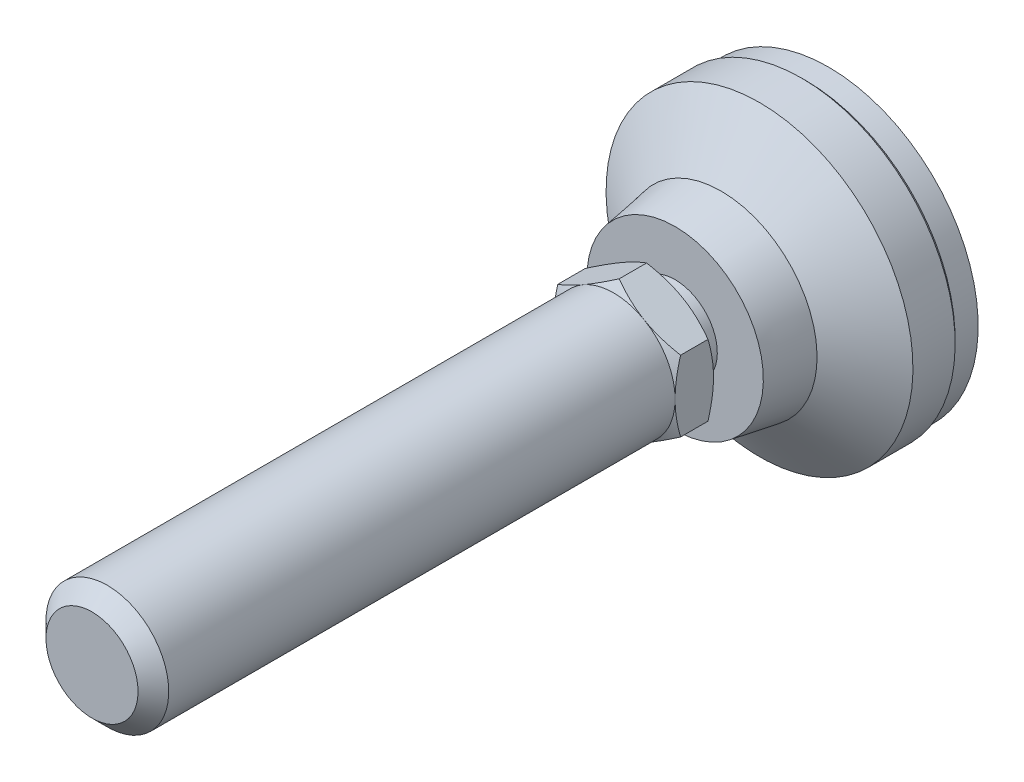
ISO-10303-21;
HEADER;
FILE_DESCRIPTION(('STEP AP214'),'2;1');
FILE_NAME('part.step','',(''),(''),'','','');
FILE_SCHEMA(('AUTOMOTIVE_DESIGN { 1 0 10303 214 1 1 1 1 }'));
ENDSEC;
DATA;
#1=APPLICATION_CONTEXT('core data for automotive mechanical design processes');
#2=APPLICATION_PROTOCOL_DEFINITION('international standard','automotive_design',2000,#1);
#3=PRODUCT_CONTEXT('',#1,'mechanical');
#4=PRODUCT('Part','Part','',(#3));
#5=PRODUCT_RELATED_PRODUCT_CATEGORY('part','',(#4));
#6=PRODUCT_DEFINITION_FORMATION('','',#4);
#7=PRODUCT_DEFINITION_CONTEXT('part definition',#1,'design');
#8=PRODUCT_DEFINITION('design','',#6,#7);
#9=PRODUCT_DEFINITION_SHAPE('','',#8);
#10=(LENGTH_UNIT() NAMED_UNIT(*) SI_UNIT(.MILLI.,.METRE.));
#11=(NAMED_UNIT(*) PLANE_ANGLE_UNIT() SI_UNIT($,.RADIAN.));
#12=(NAMED_UNIT(*) SI_UNIT($,.STERADIAN.) SOLID_ANGLE_UNIT());
#13=UNCERTAINTY_MEASURE_WITH_UNIT(LENGTH_MEASURE(1.E-05),#10,'distance_accuracy_value','');
#14=(GEOMETRIC_REPRESENTATION_CONTEXT(3) GLOBAL_UNCERTAINTY_ASSIGNED_CONTEXT((#13)) GLOBAL_UNIT_ASSIGNED_CONTEXT((#10,
#11,#12)) REPRESENTATION_CONTEXT('',''));
#15=CARTESIAN_POINT('',(0.,0.,0.));
#16=DIRECTION('',(0.,0.,1.));
#17=DIRECTION('',(1.,0.,0.));
#18=AXIS2_PLACEMENT_3D('',#15,#16,#17);
#19=CARTESIAN_POINT('',(0.,0.,2.));
#20=DIRECTION('',(0.,0.,-1.));
#21=DIRECTION('',(0.,1.,0.));
#22=AXIS2_PLACEMENT_3D('',#19,#20,#21);
#23=CYLINDRICAL_SURFACE('',#22,20.);
#24=CARTESIAN_POINT('',(0.,0.,3.5));
#25=DIRECTION('',(0.,0.,-1.));
#26=DIRECTION('',(0.,1.,0.));
#27=AXIS2_PLACEMENT_3D('',#24,#25,#26);
#28=CIRCLE('',#27,20.);
#29=CARTESIAN_POINT('',(0.,20.,3.5));
#30=VERTEX_POINT('',#29);
#31=EDGE_CURVE('E169',#30,#30,#28,.F.);
#32=ORIENTED_EDGE('',*,*,#31,.T.);
#33=EDGE_LOOP('',(#32));
#34=FACE_BOUND('',#33,.T.);
#35=CARTESIAN_POINT('',(0.,0.,9.));
#36=DIRECTION('',(0.,0.,-1.));
#37=DIRECTION('',(0.,1.,0.));
#38=AXIS2_PLACEMENT_3D('',#35,#36,#37);
#39=CIRCLE('',#38,20.);
#40=CARTESIAN_POINT('',(0.,20.,9.));
#41=VERTEX_POINT('',#40);
#42=EDGE_CURVE('E143',#41,#41,#39,.T.);
#43=ORIENTED_EDGE('',*,*,#42,.T.);
#44=EDGE_LOOP('',(#43));
#45=FACE_BOUND('',#44,.T.);
#46=ADVANCED_FACE('F14',(#34,#45),#23,.T.);
#47=CARTESIAN_POINT('',(0.,0.,2.));
#48=DIRECTION('',(0.,0.,-1.));
#49=DIRECTION('',(0.,1.,0.));
#50=AXIS2_PLACEMENT_3D('',#47,#48,#49);
#51=CYLINDRICAL_SURFACE('',#50,5.50000000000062);
#52=CARTESIAN_POINT('',(0.,0.,20.));
#53=DIRECTION('',(0.,0.,-1.));
#54=DIRECTION('',(0.,1.,0.));
#55=AXIS2_PLACEMENT_3D('',#52,#53,#54);
#56=CIRCLE('',#55,5.50000000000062);
#57=CARTESIAN_POINT('',(0.,5.50000000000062,20.));
#58=VERTEX_POINT('',#57);
#59=EDGE_CURVE('E153',#58,#58,#56,.T.);
#60=ORIENTED_EDGE('',*,*,#59,.F.);
#61=EDGE_LOOP('',(#60));
#62=FACE_BOUND('',#61,.T.);
#63=CARTESIAN_POINT('',(0.,0.,22.9999999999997));
#64=DIRECTION('',(0.,0.,-1.));
#65=DIRECTION('',(0.,1.,0.));
#66=AXIS2_PLACEMENT_3D('',#63,#64,#65);
#67=CIRCLE('',#66,5.50000000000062);
#68=CARTESIAN_POINT('',(0.,5.50000000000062,22.9999999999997));
#69=VERTEX_POINT('',#68);
#70=EDGE_CURVE('E134',#69,#69,#67,.T.);
#71=ORIENTED_EDGE('',*,*,#70,.T.);
#72=EDGE_LOOP('',(#71));
#73=FACE_BOUND('',#72,.T.);
#74=ADVANCED_FACE('F298',(#62,#73),#51,.T.);
#75=CARTESIAN_POINT('',(-11.5,0.,20.));
#76=DIRECTION('',(0.,0.,-1.));
#77=DIRECTION('',(0.,1.,0.));
#78=AXIS2_PLACEMENT_3D('',#75,#76,#77);
#79=PLANE('',#78);
#80=CARTESIAN_POINT('',(0.,0.,20.));
#81=DIRECTION('',(0.,0.,-1.));
#82=DIRECTION('',(0.,1.,0.));
#83=AXIS2_PLACEMENT_3D('',#80,#81,#82);
#84=CIRCLE('',#83,11.5);
#85=CARTESIAN_POINT('',(0.,11.5,20.));
#86=VERTEX_POINT('',#85);
#87=EDGE_CURVE('E150',#86,#86,#84,.T.);
#88=ORIENTED_EDGE('',*,*,#87,.F.);
#89=EDGE_LOOP('',(#88));
#90=FACE_BOUND('',#89,.T.);
#91=ORIENTED_EDGE('',*,*,#59,.T.);
#92=EDGE_LOOP('',(#91));
#93=FACE_BOUND('',#92,.T.);
#94=ADVANCED_FACE('F304',(#90,#93),#79,.F.);
#95=CARTESIAN_POINT('',(0.,0.,20.));
#96=DIRECTION('',(0.,0.,-1.));
#97=DIRECTION('',(0.,1.,0.));
#98=AXIS2_PLACEMENT_3D('',#95,#96,#97);
#99=CONICAL_SURFACE('',#98,11.5,0.165148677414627);
#100=CARTESIAN_POINT('',(0.,0.,14.));
#101=DIRECTION('',(0.,0.,-1.));
#102=DIRECTION('',(0.,1.,0.));
#103=AXIS2_PLACEMENT_3D('',#100,#101,#102);
#104=CIRCLE('',#103,12.5);
#105=CARTESIAN_POINT('',(0.,12.5,14.));
#106=VERTEX_POINT('',#105);
#107=EDGE_CURVE('E146',#106,#106,#104,.T.);
#108=ORIENTED_EDGE('',*,*,#107,.F.);
#109=EDGE_LOOP('',(#108));
#110=FACE_BOUND('',#109,.T.);
#111=ORIENTED_EDGE('',*,*,#87,.T.);
#112=EDGE_LOOP('',(#111));
#113=FACE_BOUND('',#112,.T.);
#114=ADVANCED_FACE('F313',(#110,#113),#99,.T.);
#115=CARTESIAN_POINT('',(0.,0.,14.));
#116=DIRECTION('',(0.,0.,-1.));
#117=DIRECTION('',(0.,1.,0.));
#118=AXIS2_PLACEMENT_3D('',#115,#116,#117);
#119=CONICAL_SURFACE('',#118,12.5,0.982793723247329);
#120=ORIENTED_EDGE('',*,*,#42,.F.);
#121=EDGE_LOOP('',(#120));
#122=FACE_BOUND('',#121,.T.);
#123=ORIENTED_EDGE('',*,*,#107,.T.);
#124=EDGE_LOOP('',(#123));
#125=FACE_BOUND('',#124,.T.);
#126=ADVANCED_FACE('F309',(#122,#125),#119,.T.);
#127=CARTESIAN_POINT('',(0.,-5.50000000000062,22.9999999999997));
#128=DIRECTION('',(0.,0.,-1.));
#129=DIRECTION('',(0.,1.,0.));
#130=AXIS2_PLACEMENT_3D('',#127,#128,#129);
#131=PLANE('',#130);
#132=CARTESIAN_POINT('',(0.,0.,22.9999999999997));
#133=DIRECTION('',(0.,0.,1.));
#134=DIRECTION('',(0.,-1.,0.));
#135=AXIS2_PLACEMENT_3D('',#132,#133,#134);
#136=CIRCLE('',#135,8.00000000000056);
#137=CARTESIAN_POINT('',(-4.,6.92820323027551,22.9999999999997));
#138=VERTEX_POINT('',#137);
#139=CARTESIAN_POINT('',(-8.,0.,22.9999999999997));
#140=VERTEX_POINT('',#139);
#141=EDGE_CURVE('E417',#138,#140,#136,.T.);
#142=ORIENTED_EDGE('',*,*,#141,.F.);
#143=CARTESIAN_POINT('',(4.,6.92820323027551,22.9999999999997));
#144=VERTEX_POINT('',#143);
#145=EDGE_CURVE('E115',#144,#138,#136,.T.);
#146=ORIENTED_EDGE('',*,*,#145,.F.);
#147=CARTESIAN_POINT('',(8.,0.,22.9999999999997));
#148=VERTEX_POINT('',#147);
#149=EDGE_CURVE('E422',#148,#144,#136,.T.);
#150=ORIENTED_EDGE('',*,*,#149,.F.);
#151=CARTESIAN_POINT('',(4.,-6.92820323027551,22.9999999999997));
#152=VERTEX_POINT('',#151);
#153=EDGE_CURVE('E35',#152,#148,#136,.T.);
#154=ORIENTED_EDGE('',*,*,#153,.F.);
#155=CARTESIAN_POINT('',(-4.,-6.92820323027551,22.9999999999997));
#156=VERTEX_POINT('',#155);
#157=EDGE_CURVE('E43',#156,#152,#136,.T.);
#158=ORIENTED_EDGE('',*,*,#157,.F.);
#159=EDGE_CURVE('E420',#140,#156,#136,.T.);
#160=ORIENTED_EDGE('',*,*,#159,.F.);
#161=EDGE_LOOP('',(#142,#146,#150,#154,#158,#160));
#162=FACE_BOUND('',#161,.T.);
#163=ORIENTED_EDGE('',*,*,#70,.F.);
#164=EDGE_LOOP('',(#163));
#165=FACE_BOUND('',#164,.T.);
#166=ADVANCED_FACE('F312',(#162,#165),#131,.T.);
#167=CARTESIAN_POINT('',(0.,0.,3.));
#168=DIRECTION('',(0.,0.,1.));
#169=DIRECTION('',(0.,-1.,0.));
#170=AXIS2_PLACEMENT_3D('',#167,#168,#169);
#171=CONICAL_SURFACE('',#170,19.5,0.785398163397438);
#172=ORIENTED_EDGE('',*,*,#31,.F.);
#173=EDGE_LOOP('',(#172));
#174=FACE_BOUND('',#173,.T.);
#175=CARTESIAN_POINT('',(0.,0.,3.));
#176=DIRECTION('',(0.,0.,-1.));
#177=DIRECTION('',(0.,1.,0.));
#178=AXIS2_PLACEMENT_3D('',#175,#176,#177);
#179=CIRCLE('',#178,19.5);
#180=CARTESIAN_POINT('',(0.,19.5,3.));
#181=VERTEX_POINT('',#180);
#182=EDGE_CURVE('E166',#181,#181,#179,.T.);
#183=ORIENTED_EDGE('',*,*,#182,.F.);
#184=EDGE_LOOP('',(#183));
#185=FACE_BOUND('',#184,.T.);
#186=ADVANCED_FACE('F16',(#174,#185),#171,.T.);
#187=CARTESIAN_POINT('',(0.,0.,0.));
#188=DIRECTION('',(0.,0.,1.));
#189=DIRECTION('',(0.,-1.,0.));
#190=AXIS2_PLACEMENT_3D('',#187,#188,#189);
#191=CYLINDRICAL_SURFACE('',#190,19.5);
#192=CARTESIAN_POINT('',(0.,0.,0.));
#193=DIRECTION('',(0.,0.,-1.));
#194=DIRECTION('',(0.,1.,0.));
#195=AXIS2_PLACEMENT_3D('',#192,#193,#194);
#196=CIRCLE('',#195,19.5);
#197=CARTESIAN_POINT('',(0.,19.5,0.));
#198=VERTEX_POINT('',#197);
#199=EDGE_CURVE('E139',#198,#198,#196,.T.);
#200=ORIENTED_EDGE('',*,*,#199,.F.);
#201=EDGE_LOOP('',(#200));
#202=FACE_BOUND('',#201,.T.);
#203=ORIENTED_EDGE('',*,*,#182,.T.);
#204=EDGE_LOOP('',(#203));
#205=FACE_BOUND('',#204,.T.);
#206=ADVANCED_FACE('F352',(#202,#205),#191,.T.);
#207=CARTESIAN_POINT('',(0.,0.,0.));
#208=DIRECTION('',(0.,0.,-1.));
#209=DIRECTION('',(0.,1.,0.));
#210=AXIS2_PLACEMENT_3D('',#207,#208,#209);
#211=PLANE('',#210);
#212=ORIENTED_EDGE('',*,*,#199,.T.);
#213=EDGE_LOOP('',(#212));
#214=FACE_BOUND('',#213,.T.);
#215=ADVANCED_FACE('F189',(#214),#211,.T.);
#216=CARTESIAN_POINT('',(0.,0.,22.9999999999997));
#217=DIRECTION('',(0.,0.,1.));
#218=DIRECTION('',(0.,-1.,0.));
#219=AXIS2_PLACEMENT_3D('',#216,#217,#218);
#220=CONICAL_SURFACE('',#219,8.00000000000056,1.0471975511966);
#221=CARTESIAN_POINT('',(-0.000199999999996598,9.23771977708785,23.7145978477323));
#222=CARTESIAN_POINT('',(0.1756487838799,9.13619343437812,23.6559907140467));
#223=CARTESIAN_POINT('',(0.352153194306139,9.03428856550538,23.6000434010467));
#224=CARTESIAN_POINT('',(0.706595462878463,8.82965122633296,23.494201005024));
#225=CARTESIAN_POINT('',(0.884533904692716,8.72691841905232,23.4443085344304));
#226=CARTESIAN_POINT('',(1.42119823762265,8.41707512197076,23.3046927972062));
#227=CARTESIAN_POINT('',(1.78204258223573,8.20874154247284,23.2252811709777));
#228=CARTESIAN_POINT('',(2.32203917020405,7.89697436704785,23.1321616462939));
#229=CARTESIAN_POINT('',(2.49957818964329,7.79447216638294,23.1056345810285));
#230=CARTESIAN_POINT('',(2.8554591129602,7.58900421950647,23.0611531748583));
#231=CARTESIAN_POINT('',(3.03380094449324,7.4860385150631,23.043198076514));
#232=CARTESIAN_POINT('',(3.3907916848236,7.27992981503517,23.0163156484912));
#233=CARTESIAN_POINT('',(3.5694400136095,7.17678715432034,23.0073780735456));
#234=CARTESIAN_POINT('',(3.92690170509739,6.97040655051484,22.9987223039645));
#235=CARTESIAN_POINT('',(4.10571506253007,6.86716861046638,22.9990038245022));
#236=CARTESIAN_POINT('',(4.44001336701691,6.67416139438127,23.0081450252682));
#237=CARTESIAN_POINT('',(4.59552190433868,6.58437849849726,23.0158896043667));
#238=CARTESIAN_POINT('',(4.90617476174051,6.40502298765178,23.0382011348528));
#239=CARTESIAN_POINT('',(5.06131905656,6.31545038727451,23.0527685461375));
#240=CARTESIAN_POINT('',(5.52615131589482,6.04707935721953,23.1063606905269));
#241=CARTESIAN_POINT('',(5.83501648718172,5.86875596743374,23.1552686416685));
#242=CARTESIAN_POINT('',(6.4560232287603,5.51021755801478,23.2775394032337));
#243=CARTESIAN_POINT('',(6.76808554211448,5.3300482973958,23.3514205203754));
#244=CARTESIAN_POINT('',(7.38755648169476,4.97239658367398,23.5191001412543));
#245=CARTESIAN_POINT('',(7.69497304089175,4.79490955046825,23.6128592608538));
#246=CARTESIAN_POINT('',(8.0002,4.61868668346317,23.7145978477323));
#247=B_SPLINE_CURVE_WITH_KNOTS('',3,(#221,#222,#223,#224,#225,#226,#227,#228,#229,#230,#231,
#232,#233,#234,#235,#236,#237,#238,#239,#240,#241,#242,#243,#244,#245,#246),.UNSPECIFIED.,.F.,
.F.,(4,2,2,2,2,2,2,2,2,2,2,2,4),(0.,0.63397354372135,1.26821965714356,2.53934712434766,
3.15934343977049,3.77928496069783,4.39852133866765,5.01773858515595,5.55680239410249,
6.09590254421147,7.17487077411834,8.27776850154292,9.37850115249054),.UNSPECIFIED.);
#248=CARTESIAN_POINT('',(0.,9.23760430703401,23.7145311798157));
#249=VERTEX_POINT('',#248);
#250=EDGE_CURVE('E112',#249,#144,#247,.T.);
#251=ORIENTED_EDGE('',*,*,#250,.T.);
#252=ORIENTED_EDGE('',*,*,#145,.T.);
#253=CARTESIAN_POINT('',(-8.0002,4.61868668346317,23.7145978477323));
#254=CARTESIAN_POINT('',(-7.8243512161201,4.7202130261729,23.6559907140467));
#255=CARTESIAN_POINT('',(-7.64784680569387,4.82211789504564,23.6000434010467));
#256=CARTESIAN_POINT('',(-7.29340453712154,5.02675523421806,23.494201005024));
#257=CARTESIAN_POINT('',(-7.11546609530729,5.1294880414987,23.4443085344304));
#258=CARTESIAN_POINT('',(-6.57880176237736,5.43933133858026,23.3046927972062));
#259=CARTESIAN_POINT('',(-6.21795741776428,5.64766491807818,23.2252811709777));
#260=CARTESIAN_POINT('',(-5.67796082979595,5.95943209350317,23.1321616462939));
#261=CARTESIAN_POINT('',(-5.50042181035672,6.06193429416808,23.1056345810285));
#262=CARTESIAN_POINT('',(-5.1445408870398,6.26740224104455,23.0611531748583));
#263=CARTESIAN_POINT('',(-4.96619905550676,6.37036794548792,23.043198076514));
#264=CARTESIAN_POINT('',(-4.60920831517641,6.57647664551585,23.0163156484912));
#265=CARTESIAN_POINT('',(-4.4305599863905,6.67961930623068,23.0073780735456));
#266=CARTESIAN_POINT('',(-4.07309829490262,6.88599991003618,22.9987223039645));
#267=CARTESIAN_POINT('',(-3.89428493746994,6.98923785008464,22.9990038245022));
#268=CARTESIAN_POINT('',(-3.5599866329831,7.18224506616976,23.0081450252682));
#269=CARTESIAN_POINT('',(-3.40447809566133,7.27202796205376,23.0158896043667));
#270=CARTESIAN_POINT('',(-3.09382523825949,7.45138347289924,23.0382011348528));
#271=CARTESIAN_POINT('',(-2.93868094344,7.54095607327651,23.0527685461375));
#272=CARTESIAN_POINT('',(-2.47384868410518,7.80932710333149,23.1063606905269));
#273=CARTESIAN_POINT('',(-2.16498351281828,7.98765049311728,23.1552686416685));
#274=CARTESIAN_POINT('',(-1.5439767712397,8.34618890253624,23.2775394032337));
#275=CARTESIAN_POINT('',(-1.23191445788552,8.52635816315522,23.3514205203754));
#276=CARTESIAN_POINT('',(-0.612443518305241,8.88400987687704,23.5191001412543));
#277=CARTESIAN_POINT('',(-0.305026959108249,9.06149691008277,23.6128592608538));
#278=CARTESIAN_POINT('',(0.000200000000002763,9.23771977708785,23.7145978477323));
#279=B_SPLINE_CURVE_WITH_KNOTS('',3,(#253,#254,#255,#256,#257,#258,#259,#260,#261,#262,#263,
#264,#265,#266,#267,#268,#269,#270,#271,#272,#273,#274,#275,#276,#277,#278),.UNSPECIFIED.,.F.,
.F.,(4,2,2,2,2,2,2,2,2,2,2,2,4),(0.,0.63397354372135,1.26821965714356,2.53934712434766,
3.15934343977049,3.77928496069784,4.39852133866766,5.01773858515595,5.55680239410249,
6.09590254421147,7.17487077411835,8.27776850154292,9.37850115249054),.UNSPECIFIED.);
#280=EDGE_CURVE('E18',#138,#249,#279,.T.);
#281=ORIENTED_EDGE('',*,*,#280,.T.);
#282=EDGE_LOOP('',(#251,#252,#281));
#283=FACE_BOUND('',#282,.T.);
#284=ADVANCED_FACE('F111',(#283),#220,.T.);
#285=CARTESIAN_POINT('',(-8.,12.3452980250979,26.8744575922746));
#286=CARTESIAN_POINT('',(-8.,11.9964002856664,26.7054586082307));
#287=CARTESIAN_POINT('',(-8.,11.6466950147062,26.5380978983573));
#288=CARTESIAN_POINT('',(-8.,10.9452397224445,26.2075756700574));
#289=CARTESIAN_POINT('',(-8.,10.593489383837,26.0444148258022));
#290=CARTESIAN_POINT('',(-8.,9.88567226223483,25.7223809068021));
#291=CARTESIAN_POINT('',(-8.,9.52959236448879,25.5635365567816));
#292=CARTESIAN_POINT('',(-8.,8.81457896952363,25.2524307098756));
#293=CARTESIAN_POINT('',(-8.,8.45564560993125,25.1001688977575));
#294=CARTESIAN_POINT('',(-8.,7.72299748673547,24.7993044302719));
#295=CARTESIAN_POINT('',(-8.,7.34917295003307,24.6509675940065));
#296=CARTESIAN_POINT('',(-8.,6.59712864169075,24.3656699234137));
#297=CARTESIAN_POINT('',(-8.,6.21890837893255,24.2287103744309));
#298=CARTESIAN_POINT('',(-8.,5.45819435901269,23.969808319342));
#299=CARTESIAN_POINT('',(-8.,5.07571124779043,23.847834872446));
#300=CARTESIAN_POINT('',(-8.,4.30527298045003,23.6228576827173));
#301=CARTESIAN_POINT('',(-8.,3.91731960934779,23.5198478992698));
#302=CARTESIAN_POINT('',(-8.,3.13780256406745,23.3383347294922));
#303=CARTESIAN_POINT('',(-8.,2.74627022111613,23.2597004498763));
#304=CARTESIAN_POINT('',(-8.,2.1554558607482,23.1634642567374));
#305=CARTESIAN_POINT('',(-8.,1.95791675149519,23.1350034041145));
#306=CARTESIAN_POINT('',(-8.,1.56187768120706,23.08587970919));
#307=CARTESIAN_POINT('',(-8.,1.36337781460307,23.0652161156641));
#308=CARTESIAN_POINT('',(-8.,0.968248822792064,23.0323545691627));
#309=CARTESIAN_POINT('',(-8.,0.771628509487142,23.0200510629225));
#310=CARTESIAN_POINT('',(-8.,0.378044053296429,23.0037654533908));
#311=CARTESIAN_POINT('',(-8.,0.181079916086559,22.9997832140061));
#312=CARTESIAN_POINT('',(-8.,-0.212840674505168,23.0002349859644));
#313=CARTESIAN_POINT('',(-8.,-0.409797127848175,23.0046690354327));
#314=CARTESIAN_POINT('',(-8.,-0.803349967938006,23.0218460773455));
#315=CARTESIAN_POINT('',(-8.,-0.999946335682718,23.0345894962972));
#316=CARTESIAN_POINT('',(-8.,-1.47431571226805,23.0750957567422));
#317=CARTESIAN_POINT('',(-8.,-1.75175021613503,23.1069059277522));
#318=CARTESIAN_POINT('',(-8.,-2.30450638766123,23.1853239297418));
#319=CARTESIAN_POINT('',(-8.,-2.57982775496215,23.2319338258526));
#320=CARTESIAN_POINT('',(-8.,-3.40233840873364,23.3914869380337));
#321=CARTESIAN_POINT('',(-8.,-3.94575520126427,23.5241227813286));
#322=CARTESIAN_POINT('',(-8.,-4.75820416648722,23.7534422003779));
#323=CARTESIAN_POINT('',(-8.,-5.03146791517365,23.8359903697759));
#324=CARTESIAN_POINT('',(-8.,-5.57534028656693,24.0094912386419));
#325=CARTESIAN_POINT('',(-8.,-5.84594889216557,24.1004439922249));
#326=CARTESIAN_POINT('',(-8.,-6.38459916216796,24.2893088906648));
#327=CARTESIAN_POINT('',(-8.,-6.65264167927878,24.3872186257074));
#328=CARTESIAN_POINT('',(-8.,-7.18651763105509,24.5888624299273));
#329=CARTESIAN_POINT('',(-8.,-7.45235108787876,24.6925964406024));
#330=CARTESIAN_POINT('',(-8.,-8.06393825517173,24.9377403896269));
#331=CARTESIAN_POINT('',(-8.,-8.40899543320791,25.0808844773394));
#332=CARTESIAN_POINT('',(-8.,-9.09629864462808,25.3737878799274));
#333=CARTESIAN_POINT('',(-8.,-9.43854452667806,25.5235475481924));
#334=CARTESIAN_POINT('',(-8.,-10.1207213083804,25.8283978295));
#335=CARTESIAN_POINT('',(-8.,-10.4606517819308,25.9834893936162));
#336=CARTESIAN_POINT('',(-8.,-11.1385211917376,26.2979727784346));
#337=CARTESIAN_POINT('',(-8.,-11.4764600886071,26.4573646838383));
#338=CARTESIAN_POINT('',(-8.,-12.1509857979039,26.7798218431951));
#339=CARTESIAN_POINT('',(-8.,-12.4875709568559,26.942890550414));
#340=CARTESIAN_POINT('',(-8.,-13.1593147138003,27.271942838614));
#341=CARTESIAN_POINT('',(-8.,-13.4944732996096,27.4379264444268));
#342=CARTESIAN_POINT('',(-8.,-14.4980597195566,27.9394572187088));
#343=CARTESIAN_POINT('',(-8.,-15.1646789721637,28.278623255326));
#344=CARTESIAN_POINT('',(-8.,-16.4411826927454,28.9363993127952));
#345=CARTESIAN_POINT('',(-8.,-17.051339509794,29.254483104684));
#346=CARTESIAN_POINT('',(-8.,-18.2693616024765,29.8950512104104));
#347=CARTESIAN_POINT('',(-8.,-18.8772268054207,30.2175356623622));
#348=CARTESIAN_POINT('',(-8.,-20.0897517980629,30.8651219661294));
#349=CARTESIAN_POINT('',(-8.,-20.694415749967,31.1902160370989));
#350=CARTESIAN_POINT('',(-8.,-21.9022685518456,31.8430603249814));
#351=CARTESIAN_POINT('',(-8.,-22.5054574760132,32.170810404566));
#352=CARTESIAN_POINT('',(-8.,-23.1080988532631,32.4995574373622));
#353=B_SPLINE_CURVE_WITH_KNOTS('',3,(#285,#286,#287,#288,#289,#290,#291,#292,#293,#294,#295,
#296,#297,#298,#299,#300,#301,#302,#303,#304,#305,#306,#307,#308,#309,#310,#311,#312,#313,#314,
#315,#316,#317,#318,#319,#320,#321,#322,#323,#324,#325,#326,#327,#328,#329,#330,#331,#332,#333,
#334,#335,#336,#337,#338,#339,#340,#341,#342,#343,#344,#345,#346,#347,#348,#349,#350,#351,#352),
.UNSPECIFIED.,.F.,.F.,(4,2,2,2,2,2,2,2,2,2,2,2,2,2,2,2,2,2,2,2,2,2,2,2,2,2,2,2,2,2,2,2,2,4),(0.,
1.16303324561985,2.3262520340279,3.49590795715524,4.66550780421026,5.87190358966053,
7.07843548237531,8.28243290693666,9.4860461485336,10.6830794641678,11.2816863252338,
11.8802354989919,12.4710796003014,13.0619140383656,13.6527511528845,14.2436185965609,
15.0809007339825,15.9182997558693,17.5940550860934,18.450365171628,19.3066807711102,
20.1627011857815,21.018713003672,22.1393323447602,23.2600116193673,24.3808918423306,
25.5017941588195,26.6237971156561,27.7458096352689,29.9895657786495,32.0538182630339,
34.1181356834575,36.1776775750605,38.2371136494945),.UNSPECIFIED.);
#354=CARTESIAN_POINT('',(-8.,4.61880215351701,23.7145311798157));
#355=VERTEX_POINT('',#354);
#356=EDGE_CURVE('E391',#140,#355,#353,.F.);
#357=ORIENTED_EDGE('',*,*,#356,.T.);
#358=EDGE_CURVE('E9',#355,#138,#279,.T.);
#359=ORIENTED_EDGE('',*,*,#358,.T.);
#360=ORIENTED_EDGE('',*,*,#141,.T.);
#361=EDGE_LOOP('',(#357,#359,#360));
#362=FACE_BOUND('',#361,.T.);
#363=ADVANCED_FACE('F187',(#362),#220,.T.);
#364=CARTESIAN_POINT('',(0.000200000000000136,-9.23771977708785,23.7145978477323));
#365=CARTESIAN_POINT('',(-0.175648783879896,-9.13619343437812,23.6559907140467));
#366=CARTESIAN_POINT('',(-0.352153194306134,-9.03428856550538,23.6000434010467));
#367=CARTESIAN_POINT('',(-0.706595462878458,-8.82965122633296,23.494201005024));
#368=CARTESIAN_POINT('',(-0.88453390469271,-8.72691841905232,23.4443085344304));
#369=CARTESIAN_POINT('',(-1.42119823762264,-8.41707512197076,23.3046927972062));
#370=CARTESIAN_POINT('',(-1.78204258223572,-8.20874154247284,23.2252811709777));
#371=CARTESIAN_POINT('',(-2.32203917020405,-7.89697436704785,23.1321616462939));
#372=CARTESIAN_POINT('',(-2.49957818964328,-7.79447216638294,23.1056345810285));
#373=CARTESIAN_POINT('',(-2.8554591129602,-7.58900421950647,23.0611531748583));
#374=CARTESIAN_POINT('',(-3.03380094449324,-7.4860385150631,23.043198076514));
#375=CARTESIAN_POINT('',(-3.39079168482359,-7.27992981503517,23.0163156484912));
#376=CARTESIAN_POINT('',(-3.5694400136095,-7.17678715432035,23.0073780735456));
#377=CARTESIAN_POINT('',(-3.92690170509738,-6.97040655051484,22.9987223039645));
#378=CARTESIAN_POINT('',(-4.10571506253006,-6.86716861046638,22.9990038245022));
#379=CARTESIAN_POINT('',(-4.4400133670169,-6.67416139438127,23.0081450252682));
#380=CARTESIAN_POINT('',(-4.59552190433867,-6.58437849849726,23.0158896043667));
#381=CARTESIAN_POINT('',(-4.90617476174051,-6.40502298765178,23.0382011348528));
#382=CARTESIAN_POINT('',(-5.06131905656,-6.31545038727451,23.0527685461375));
#383=CARTESIAN_POINT('',(-5.52615131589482,-6.04707935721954,23.1063606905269));
#384=CARTESIAN_POINT('',(-5.83501648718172,-5.86875596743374,23.1552686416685));
#385=CARTESIAN_POINT('',(-6.4560232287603,-5.51021755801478,23.2775394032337));
#386=CARTESIAN_POINT('',(-6.76808554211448,-5.3300482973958,23.3514205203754));
#387=CARTESIAN_POINT('',(-7.38755648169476,-4.97239658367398,23.5191001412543));
#388=CARTESIAN_POINT('',(-7.69497304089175,-4.79490955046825,23.6128592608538));
#389=CARTESIAN_POINT('',(-8.0002,-4.61868668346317,23.7145978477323));
#390=B_SPLINE_CURVE_WITH_KNOTS('',3,(#364,#365,#366,#367,#368,#369,#370,#371,#372,#373,#374,
#375,#376,#377,#378,#379,#380,#381,#382,#383,#384,#385,#386,#387,#388,#389),.UNSPECIFIED.,.F.,
.F.,(4,2,2,2,2,2,2,2,2,2,2,2,4),(0.,0.633973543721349,1.26821965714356,2.53934712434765,
3.15934343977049,3.77928496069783,4.39852133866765,5.01773858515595,5.55680239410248,
6.09590254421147,7.17487077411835,8.27776850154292,9.37850115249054),.UNSPECIFIED.);
#391=CARTESIAN_POINT('',(-8.,-4.618802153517,23.7145311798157));
#392=VERTEX_POINT('',#391);
#393=EDGE_CURVE('E383',#156,#392,#390,.T.);
#394=ORIENTED_EDGE('',*,*,#393,.T.);
#395=EDGE_CURVE('E385',#392,#140,#353,.F.);
#396=ORIENTED_EDGE('',*,*,#395,.T.);
#397=ORIENTED_EDGE('',*,*,#159,.T.);
#398=EDGE_LOOP('',(#394,#396,#397));
#399=FACE_BOUND('',#398,.T.);
#400=ADVANCED_FACE('F350',(#399),#220,.T.);
#401=CARTESIAN_POINT('',(8.0002,-4.61868668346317,23.7145978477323));
#402=CARTESIAN_POINT('',(7.8243512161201,-4.7202130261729,23.6559907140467));
#403=CARTESIAN_POINT('',(7.64784680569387,-4.82211789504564,23.6000434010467));
#404=CARTESIAN_POINT('',(7.29340453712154,-5.02675523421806,23.494201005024));
#405=CARTESIAN_POINT('',(7.11546609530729,-5.1294880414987,23.4443085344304));
#406=CARTESIAN_POINT('',(6.57880176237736,-5.43933133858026,23.3046927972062));
#407=CARTESIAN_POINT('',(6.21795741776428,-5.64766491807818,23.2252811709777));
#408=CARTESIAN_POINT('',(5.67796082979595,-5.95943209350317,23.1321616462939));
#409=CARTESIAN_POINT('',(5.50042181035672,-6.06193429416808,23.1056345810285));
#410=CARTESIAN_POINT('',(5.1445408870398,-6.26740224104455,23.0611531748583));
#411=CARTESIAN_POINT('',(4.96619905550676,-6.37036794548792,23.043198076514));
#412=CARTESIAN_POINT('',(4.60920831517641,-6.57647664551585,23.0163156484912));
#413=CARTESIAN_POINT('',(4.4305599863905,-6.67961930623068,23.0073780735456));
#414=CARTESIAN_POINT('',(4.07309829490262,-6.88599991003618,22.9987223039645));
#415=CARTESIAN_POINT('',(3.89428493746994,-6.98923785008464,22.9990038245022));
#416=CARTESIAN_POINT('',(3.5599866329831,-7.18224506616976,23.0081450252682));
#417=CARTESIAN_POINT('',(3.40447809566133,-7.27202796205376,23.0158896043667));
#418=CARTESIAN_POINT('',(3.09382523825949,-7.45138347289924,23.0382011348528));
#419=CARTESIAN_POINT('',(2.93868094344,-7.54095607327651,23.0527685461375));
#420=CARTESIAN_POINT('',(2.47384868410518,-7.80932710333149,23.1063606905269));
#421=CARTESIAN_POINT('',(2.16498351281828,-7.98765049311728,23.1552686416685));
#422=CARTESIAN_POINT('',(1.5439767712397,-8.34618890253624,23.2775394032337));
#423=CARTESIAN_POINT('',(1.23191445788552,-8.52635816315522,23.3514205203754));
#424=CARTESIAN_POINT('',(0.612443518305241,-8.88400987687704,23.5191001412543));
#425=CARTESIAN_POINT('',(0.30502695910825,-9.06149691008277,23.6128592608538));
#426=CARTESIAN_POINT('',(-0.000200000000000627,-9.23771977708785,23.7145978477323));
#427=B_SPLINE_CURVE_WITH_KNOTS('',3,(#401,#402,#403,#404,#405,#406,#407,#408,#409,#410,#411,
#412,#413,#414,#415,#416,#417,#418,#419,#420,#421,#422,#423,#424,#425,#426),.UNSPECIFIED.,.F.,
.F.,(4,2,2,2,2,2,2,2,2,2,2,2,4),(0.,0.63397354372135,1.26821965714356,2.53934712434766,
3.15934343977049,3.77928496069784,4.39852133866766,5.01773858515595,5.55680239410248,
6.09590254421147,7.17487077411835,8.27776850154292,9.37850115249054),.UNSPECIFIED.);
#428=CARTESIAN_POINT('',(0.,-9.23760430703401,23.7145311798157));
#429=VERTEX_POINT('',#428);
#430=EDGE_CURVE('E250',#152,#429,#427,.T.);
#431=ORIENTED_EDGE('',*,*,#430,.T.);
#432=EDGE_CURVE('E381',#429,#156,#390,.T.);
#433=ORIENTED_EDGE('',*,*,#432,.T.);
#434=ORIENTED_EDGE('',*,*,#157,.T.);
#435=EDGE_LOOP('',(#431,#433,#434));
#436=FACE_BOUND('',#435,.T.);
#437=ADVANCED_FACE('F343',(#436),#220,.T.);
#438=CARTESIAN_POINT('',(8.,12.3452980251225,26.8744575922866));
#439=CARTESIAN_POINT('',(8.,11.9964002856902,26.7054586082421));
#440=CARTESIAN_POINT('',(8.,11.6466950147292,26.5380978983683));
#441=CARTESIAN_POINT('',(8.,10.9452397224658,26.2075756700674));
#442=CARTESIAN_POINT('',(8.,10.5934893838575,26.0444148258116));
#443=CARTESIAN_POINT('',(8.,9.88567226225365,25.7223809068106));
#444=CARTESIAN_POINT('',(8.,9.52959236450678,25.5635365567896));
#445=CARTESIAN_POINT('',(8.,8.81457896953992,25.2524307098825));
#446=CARTESIAN_POINT('',(8.,8.45564560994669,25.100168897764));
#447=CARTESIAN_POINT('',(8.,7.72299748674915,24.7993044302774));
#448=CARTESIAN_POINT('',(8.,7.34917295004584,24.6509675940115));
#449=CARTESIAN_POINT('',(8.,6.59712864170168,24.3656699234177));
#450=CARTESIAN_POINT('',(8.,6.21890837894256,24.2287103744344));
#451=CARTESIAN_POINT('',(8.,5.45819435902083,23.9698083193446));
#452=CARTESIAN_POINT('',(8.,5.07571124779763,23.8478348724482));
#453=CARTESIAN_POINT('',(8.,4.30527298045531,23.6228576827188));
#454=CARTESIAN_POINT('',(8.,3.9173196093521,23.5198478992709));
#455=CARTESIAN_POINT('',(8.,3.13780256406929,23.3383347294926));
#456=CARTESIAN_POINT('',(8.,2.7462702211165,23.2597004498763));
#457=CARTESIAN_POINT('',(8.,2.15545586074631,23.1634642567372));
#458=CARTESIAN_POINT('',(8.,1.95791675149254,23.1350034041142));
#459=CARTESIAN_POINT('',(8.,1.56187768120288,23.0858797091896));
#460=CARTESIAN_POINT('',(8.,1.36337781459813,23.0652161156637));
#461=CARTESIAN_POINT('',(8.,0.96824882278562,23.0323545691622));
#462=CARTESIAN_POINT('',(8.,0.771628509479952,23.0200510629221));
#463=CARTESIAN_POINT('',(8.,0.378044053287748,23.0037654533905));
#464=CARTESIAN_POINT('',(8.,0.181079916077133,22.9997832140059));
#465=CARTESIAN_POINT('',(8.,-0.212840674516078,23.0002349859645));
#466=CARTESIAN_POINT('',(8.,-0.409797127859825,23.004669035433));
#467=CARTESIAN_POINT('',(8.,-0.803349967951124,23.0218460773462));
#468=CARTESIAN_POINT('',(8.,-0.999946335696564,23.0345894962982));
#469=CARTESIAN_POINT('',(8.,-1.47431571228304,23.0750957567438));
#470=CARTESIAN_POINT('',(8.,-1.75175021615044,23.1069059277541));
#471=CARTESIAN_POINT('',(8.,-2.30450638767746,23.1853239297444));
#472=CARTESIAN_POINT('',(8.,-2.57982775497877,23.2319338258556));
#473=CARTESIAN_POINT('',(8.,-3.40233840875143,23.3914869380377));
#474=CARTESIAN_POINT('',(8.,-3.94575520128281,23.5241227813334));
#475=CARTESIAN_POINT('',(8.,-4.75820416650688,23.7534422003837));
#476=CARTESIAN_POINT('',(8.,-5.0314679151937,23.835990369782));
#477=CARTESIAN_POINT('',(8.,-5.57534028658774,24.0094912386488));
#478=CARTESIAN_POINT('',(8.,-5.84594889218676,24.1004439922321));
#479=CARTESIAN_POINT('',(8.,-6.3845991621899,24.2893088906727));
#480=CARTESIAN_POINT('',(8.,-6.6526416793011,24.3872186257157));
#481=CARTESIAN_POINT('',(8.,-7.18651763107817,24.5888624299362));
#482=CARTESIAN_POINT('',(8.,-7.45235108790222,24.6925964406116));
#483=CARTESIAN_POINT('',(8.,-8.06393825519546,24.9377403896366));
#484=CARTESIAN_POINT('',(8.,-8.40899543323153,25.0808844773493));
#485=CARTESIAN_POINT('',(8.,-9.09629864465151,25.3737878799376));
#486=CARTESIAN_POINT('',(8.,-9.4385445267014,25.5235475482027));
#487=CARTESIAN_POINT('',(8.,-10.1207213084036,25.8283978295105));
#488=CARTESIAN_POINT('',(8.,-10.4606517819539,25.9834893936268));
#489=CARTESIAN_POINT('',(8.,-11.1385211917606,26.2979727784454));
#490=CARTESIAN_POINT('',(8.,-11.4764600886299,26.4573646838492));
#491=CARTESIAN_POINT('',(8.,-12.1509857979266,26.779821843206));
#492=CARTESIAN_POINT('',(8.,-12.4875709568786,26.942890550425));
#493=CARTESIAN_POINT('',(8.,-13.1593147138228,27.2719428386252));
#494=CARTESIAN_POINT('',(8.,-13.4944732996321,27.4379264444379));
#495=CARTESIAN_POINT('',(8.,-14.4980597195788,27.9394572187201));
#496=CARTESIAN_POINT('',(8.,-15.1646789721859,28.2786232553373));
#497=CARTESIAN_POINT('',(8.,-16.4411826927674,28.9363993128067));
#498=CARTESIAN_POINT('',(8.,-17.051339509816,29.2544831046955));
#499=CARTESIAN_POINT('',(8.,-18.2693616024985,29.895051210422));
#500=CARTESIAN_POINT('',(7.99999999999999,-18.8772268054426,30.2175356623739));
#501=CARTESIAN_POINT('',(7.99999999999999,-20.0897517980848,30.8651219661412));
#502=CARTESIAN_POINT('',(7.99999999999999,-20.6944157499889,31.1902160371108));
#503=CARTESIAN_POINT('',(7.99999999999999,-21.9022685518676,31.8430603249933));
#504=CARTESIAN_POINT('',(8.,-22.5054574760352,32.170810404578));
#505=CARTESIAN_POINT('',(8.,-23.1080988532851,32.4995574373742));
#506=B_SPLINE_CURVE_WITH_KNOTS('',3,(#438,#439,#440,#441,#442,#443,#444,#445,#446,#447,#448,
#449,#450,#451,#452,#453,#454,#455,#456,#457,#458,#459,#460,#461,#462,#463,#464,#465,#466,#467,
#468,#469,#470,#471,#472,#473,#474,#475,#476,#477,#478,#479,#480,#481,#482,#483,#484,#485,#486,
#487,#488,#489,#490,#491,#492,#493,#494,#495,#496,#497,#498,#499,#500,#501,#502,#503,#504,#505),
.UNSPECIFIED.,.F.,.F.,(4,2,2,2,2,2,2,2,2,2,2,2,2,2,2,2,2,2,2,2,2,2,2,2,2,2,2,2,2,2,2,2,2,4),(0.,
1.16303324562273,2.32625203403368,3.49590795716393,4.66550780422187,5.87190358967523,
7.07843548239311,8.28243290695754,9.48604614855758,10.6830794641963,11.2816863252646,
11.880235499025,12.4710796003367,13.0619140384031,13.6527511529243,14.2436185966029,
15.0809007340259,15.918299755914,17.5940550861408,18.4503651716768,19.3066807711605,
20.1627011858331,21.018713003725,22.1393323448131,23.2600116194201,24.3808918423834,
25.5017941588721,26.6237971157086,27.7458096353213,29.9895657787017,32.0538182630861,
34.1181356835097,36.1776775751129,38.2371136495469),.UNSPECIFIED.);
#507=CARTESIAN_POINT('',(8.,-4.61880215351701,23.7145311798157));
#508=VERTEX_POINT('',#507);
#509=EDGE_CURVE('E242',#148,#508,#506,.T.);
#510=ORIENTED_EDGE('',*,*,#509,.T.);
#511=EDGE_CURVE('E249',#508,#152,#427,.T.);
#512=ORIENTED_EDGE('',*,*,#511,.T.);
#513=ORIENTED_EDGE('',*,*,#153,.T.);
#514=EDGE_LOOP('',(#510,#512,#513));
#515=FACE_BOUND('',#514,.T.);
#516=ADVANCED_FACE('F335',(#515),#220,.T.);
#517=CARTESIAN_POINT('',(8.,4.61880215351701,23.7145311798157));
#518=VERTEX_POINT('',#517);
#519=EDGE_CURVE('E127',#144,#518,#247,.T.);
#520=ORIENTED_EDGE('',*,*,#519,.T.);
#521=EDGE_CURVE('E248',#518,#148,#506,.T.);
#522=ORIENTED_EDGE('',*,*,#521,.T.);
#523=ORIENTED_EDGE('',*,*,#149,.T.);
#524=EDGE_LOOP('',(#520,#522,#523));
#525=FACE_BOUND('',#524,.T.);
#526=ADVANCED_FACE('F329',(#525),#220,.T.);
#527=CARTESIAN_POINT('',(-6.00000000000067,0.,96.));
#528=DIRECTION('',(0.,0.,-1.));
#529=DIRECTION('',(0.,1.,0.));
#530=AXIS2_PLACEMENT_3D('',#527,#528,#529);
#531=PLANE('',#530);
#532=CARTESIAN_POINT('',(0.,0.,96.));
#533=DIRECTION('',(0.,0.,-1.));
#534=DIRECTION('',(0.,1.,0.));
#535=AXIS2_PLACEMENT_3D('',#532,#533,#534);
#536=CIRCLE('',#535,6.00000000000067);
#537=CARTESIAN_POINT('',(0.,6.00000000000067,96.));
#538=VERTEX_POINT('',#537);
#539=EDGE_CURVE('E159',#538,#538,#536,.T.);
#540=ORIENTED_EDGE('',*,*,#539,.F.);
#541=EDGE_LOOP('',(#540));
#542=FACE_BOUND('',#541,.T.);
#543=ADVANCED_FACE('F326',(#542),#531,.F.);
#544=CARTESIAN_POINT('',(0.,0.,96.));
#545=DIRECTION('',(0.,0.,-1.));
#546=DIRECTION('',(0.,1.,0.));
#547=AXIS2_PLACEMENT_3D('',#544,#545,#546);
#548=CONICAL_SURFACE('',#547,6.00000000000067,0.785398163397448);
#549=CARTESIAN_POINT('',(0.,0.,94.));
#550=DIRECTION('',(0.,0.,-1.));
#551=DIRECTION('',(0.,1.,0.));
#552=AXIS2_PLACEMENT_3D('',#549,#550,#551);
#553=CIRCLE('',#552,8.00000000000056);
#554=CARTESIAN_POINT('',(0.,8.00000000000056,94.));
#555=VERTEX_POINT('',#554);
#556=EDGE_CURVE('E156',#555,#555,#553,.T.);
#557=ORIENTED_EDGE('',*,*,#556,.F.);
#558=EDGE_LOOP('',(#557));
#559=FACE_BOUND('',#558,.T.);
#560=ORIENTED_EDGE('',*,*,#539,.T.);
#561=EDGE_LOOP('',(#560));
#562=FACE_BOUND('',#561,.T.);
#563=ADVANCED_FACE('F323',(#559,#562),#548,.T.);
#564=CARTESIAN_POINT('',(0.,0.,2.));
#565=DIRECTION('',(0.,0.,-1.));
#566=DIRECTION('',(0.,1.,0.));
#567=AXIS2_PLACEMENT_3D('',#564,#565,#566);
#568=CYLINDRICAL_SURFACE('',#567,8.00000000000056);
#569=ORIENTED_EDGE('',*,*,#556,.T.);
#570=EDGE_LOOP('',(#569));
#571=FACE_BOUND('',#570,.T.);
#572=CARTESIAN_POINT('',(0.,0.,28.));
#573=DIRECTION('',(0.,0.,-1.));
#574=DIRECTION('',(0.,1.,0.));
#575=AXIS2_PLACEMENT_3D('',#572,#573,#574);
#576=CIRCLE('',#575,8.00000000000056);
#577=CARTESIAN_POINT('',(4.,6.92820323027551,28.));
#578=VERTEX_POINT('',#577);
#579=CARTESIAN_POINT('',(8.,0.,28.));
#580=VERTEX_POINT('',#579);
#581=EDGE_CURVE('E165',#578,#580,#576,.T.);
#582=ORIENTED_EDGE('',*,*,#581,.F.);
#583=CARTESIAN_POINT('',(-4.,6.92820323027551,28.));
#584=VERTEX_POINT('',#583);
#585=EDGE_CURVE('E162',#584,#578,#576,.T.);
#586=ORIENTED_EDGE('',*,*,#585,.F.);
#587=CARTESIAN_POINT('',(-8.,0.,28.));
#588=VERTEX_POINT('',#587);
#589=EDGE_CURVE('E164',#588,#584,#576,.T.);
#590=ORIENTED_EDGE('',*,*,#589,.F.);
#591=CARTESIAN_POINT('',(-4.,-6.92820323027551,28.));
#592=VERTEX_POINT('',#591);
#593=EDGE_CURVE('E286',#592,#588,#576,.T.);
#594=ORIENTED_EDGE('',*,*,#593,.F.);
#595=CARTESIAN_POINT('',(4.,-6.92820323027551,28.));
#596=VERTEX_POINT('',#595);
#597=EDGE_CURVE('E285',#596,#592,#576,.T.);
#598=ORIENTED_EDGE('',*,*,#597,.F.);
#599=CARTESIAN_POINT('',(0.,0.,28.));
#600=DIRECTION('',(0.,0.,1.));
#601=DIRECTION('',(0.,-1.,0.));
#602=AXIS2_PLACEMENT_3D('',#599,#600,#601);
#603=CIRCLE('',#602,8.00000000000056);
#604=EDGE_CURVE('E128',#596,#580,#603,.T.);
#605=ORIENTED_EDGE('',*,*,#604,.T.);
#606=EDGE_LOOP('',(#582,#586,#590,#594,#598,#605));
#607=FACE_BOUND('',#606,.T.);
#608=ADVANCED_FACE('F283',(#571,#607),#568,.T.);
#609=CARTESIAN_POINT('',(0.,0.,26.598405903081));
#610=DIRECTION('',(0.,0.,-1.));
#611=DIRECTION('',(0.,1.,0.));
#612=AXIS2_PLACEMENT_3D('',#609,#610,#611);
#613=CONICAL_SURFACE('',#612,10.427632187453,1.0471975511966);
#614=CARTESIAN_POINT('',(8.,12.3452980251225,24.1255424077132));
#615=CARTESIAN_POINT('',(8.,11.9964002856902,24.2945413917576));
#616=CARTESIAN_POINT('',(8.,11.6466950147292,24.4619021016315));
#617=CARTESIAN_POINT('',(8.,10.9452397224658,24.7924243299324));
#618=CARTESIAN_POINT('',(8.,10.5934893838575,24.9555851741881));
#619=CARTESIAN_POINT('',(8.,9.88567226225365,25.2776190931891));
#620=CARTESIAN_POINT('',(8.,9.52959236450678,25.4364634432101));
#621=CARTESIAN_POINT('',(8.,8.81457896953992,25.7475692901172));
#622=CARTESIAN_POINT('',(8.,8.45564560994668,25.8998311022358));
#623=CARTESIAN_POINT('',(8.,7.72299748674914,26.2006955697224));
#624=CARTESIAN_POINT('',(8.,7.34917295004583,26.3490324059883));
#625=CARTESIAN_POINT('',(8.,6.59712864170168,26.634330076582));
#626=CARTESIAN_POINT('',(8.,6.21890837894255,26.7712896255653));
#627=CARTESIAN_POINT('',(8.,5.45819435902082,27.0301916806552));
#628=CARTESIAN_POINT('',(8.,5.07571124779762,27.1521651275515));
#629=CARTESIAN_POINT('',(8.,4.3052729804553,27.377142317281));
#630=CARTESIAN_POINT('',(8.,3.9173196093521,27.4801521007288));
#631=CARTESIAN_POINT('',(8.,3.13780256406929,27.6616652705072));
#632=CARTESIAN_POINT('',(8.,2.74627022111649,27.7402995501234));
#633=CARTESIAN_POINT('',(8.,2.1554558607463,27.8365357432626));
#634=CARTESIAN_POINT('',(8.,1.95791675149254,27.8649965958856));
#635=CARTESIAN_POINT('',(8.,1.56187768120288,27.9141202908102));
#636=CARTESIAN_POINT('',(8.,1.36337781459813,27.9347838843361));
#637=CARTESIAN_POINT('',(8.,0.968248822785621,27.9676454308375));
#638=CARTESIAN_POINT('',(8.,0.771628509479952,27.9799489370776));
#639=CARTESIAN_POINT('',(8.,0.378044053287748,27.9962345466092));
#640=CARTESIAN_POINT('',(8.,0.181079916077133,28.0002167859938));
#641=CARTESIAN_POINT('',(8.,-0.212840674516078,27.9997650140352));
#642=CARTESIAN_POINT('',(8.,-0.409797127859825,27.9953309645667));
#643=CARTESIAN_POINT('',(8.,-0.803349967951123,27.9781539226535));
#644=CARTESIAN_POINT('',(8.,-0.999946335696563,27.9654105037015));
#645=CARTESIAN_POINT('',(8.,-1.47431571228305,27.9249042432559));
#646=CARTESIAN_POINT('',(8.,-1.75175021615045,27.8930940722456));
#647=CARTESIAN_POINT('',(8.,-2.30450638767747,27.8146760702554));
#648=CARTESIAN_POINT('',(8.,-2.57982775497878,27.7680661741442));
#649=CARTESIAN_POINT('',(8.,-3.40233840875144,27.6085130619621));
#650=CARTESIAN_POINT('',(8.,-3.94575520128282,27.4758772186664));
#651=CARTESIAN_POINT('',(8.,-4.7582041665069,27.2465577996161));
#652=CARTESIAN_POINT('',(8.,-5.03146791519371,27.1640096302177));
#653=CARTESIAN_POINT('',(8.,-5.57534028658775,26.990508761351));
#654=CARTESIAN_POINT('',(8.,-5.84594889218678,26.8995560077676));
#655=CARTESIAN_POINT('',(8.,-6.38459916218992,26.7106911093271));
#656=CARTESIAN_POINT('',(8.,-6.65264167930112,26.6127813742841));
#657=CARTESIAN_POINT('',(8.,-7.18651763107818,26.4111375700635));
#658=CARTESIAN_POINT('',(8.,-7.45235108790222,26.3074035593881));
#659=CARTESIAN_POINT('',(8.,-8.06393825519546,26.0622596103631));
#660=CARTESIAN_POINT('',(8.,-8.40899543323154,25.9191155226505));
#661=CARTESIAN_POINT('',(8.,-9.09629864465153,25.6262121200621));
#662=CARTESIAN_POINT('',(8.,-9.43854452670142,25.4764524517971));
#663=CARTESIAN_POINT('',(8.,-10.1207213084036,25.1716021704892));
#664=CARTESIAN_POINT('',(8.,-10.4606517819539,25.0165106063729));
#665=CARTESIAN_POINT('',(8.,-11.1385211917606,24.7020272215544));
#666=CARTESIAN_POINT('',(8.,-11.4764600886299,24.5426353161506));
#667=CARTESIAN_POINT('',(8.,-12.1509857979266,24.2201781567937));
#668=CARTESIAN_POINT('',(8.,-12.4875709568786,24.0571094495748));
#669=CARTESIAN_POINT('',(8.,-13.1593147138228,23.7280571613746));
#670=CARTESIAN_POINT('',(8.,-13.4944732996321,23.5620735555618));
#671=CARTESIAN_POINT('',(8.,-14.4980597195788,23.0605427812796));
#672=CARTESIAN_POINT('',(8.,-15.1646789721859,22.7213767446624));
#673=CARTESIAN_POINT('',(8.,-16.4411826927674,22.0636006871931));
#674=CARTESIAN_POINT('',(8.,-17.051339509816,21.7455168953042));
#675=CARTESIAN_POINT('',(8.,-18.2693616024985,21.1049487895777));
#676=CARTESIAN_POINT('',(7.99999999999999,-18.8772268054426,20.7824643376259));
#677=CARTESIAN_POINT('',(7.99999999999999,-20.0897517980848,20.1348780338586));
#678=CARTESIAN_POINT('',(7.99999999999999,-20.694415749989,19.809783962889));
#679=CARTESIAN_POINT('',(7.99999999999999,-21.9022685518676,19.1569396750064));
#680=CARTESIAN_POINT('',(8.,-22.5054574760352,18.8291895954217));
#681=CARTESIAN_POINT('',(8.,-23.1080988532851,18.5004425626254));
#682=B_SPLINE_CURVE_WITH_KNOTS('',3,(#614,#615,#616,#617,#618,#619,#620,#621,#622,#623,#624,
#625,#626,#627,#628,#629,#630,#631,#632,#633,#634,#635,#636,#637,#638,#639,#640,#641,#642,#643,
#644,#645,#646,#647,#648,#649,#650,#651,#652,#653,#654,#655,#656,#657,#658,#659,#660,#661,#662,
#663,#664,#665,#666,#667,#668,#669,#670,#671,#672,#673,#674,#675,#676,#677,#678,#679,#680,#681),
.UNSPECIFIED.,.F.,.F.,(4,2,2,2,2,2,2,2,2,2,2,2,2,2,2,2,2,2,2,2,2,2,2,2,2,2,2,2,2,2,2,2,2,4),(0.,
1.16303324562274,2.32625203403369,3.49590795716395,4.6655078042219,5.87190358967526,
7.07843548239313,8.28243290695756,9.48604614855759,10.6830794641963,11.2816863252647,
11.880235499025,12.4710796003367,13.0619140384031,13.6527511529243,14.2436185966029,
15.0809007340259,15.918299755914,17.5940550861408,18.4503651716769,19.3066807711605,
20.1627011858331,21.0187130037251,22.1393323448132,23.2600116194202,24.3808918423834,
25.5017941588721,26.6237971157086,27.7458096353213,29.9895657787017,32.0538182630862,
34.1181356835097,36.1776775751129,38.2371136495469),.UNSPECIFIED.);
#683=CARTESIAN_POINT('',(8.,4.61880215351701,27.285468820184));
#684=VERTEX_POINT('',#683);
#685=EDGE_CURVE('E219',#580,#684,#682,.F.);
#686=ORIENTED_EDGE('',*,*,#685,.T.);
#687=CARTESIAN_POINT('',(8.0002,4.61868668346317,27.2854021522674));
#688=CARTESIAN_POINT('',(7.82435121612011,4.72021302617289,27.344009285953));
#689=CARTESIAN_POINT('',(7.64784680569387,4.82211789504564,27.3999565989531));
#690=CARTESIAN_POINT('',(7.29340453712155,5.02675523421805,27.5057989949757));
#691=CARTESIAN_POINT('',(7.11546609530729,5.12948804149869,27.5556914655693));
#692=CARTESIAN_POINT('',(6.57880176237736,5.43933133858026,27.6953072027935));
#693=CARTESIAN_POINT('',(6.21795741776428,5.64766491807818,27.774718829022));
#694=CARTESIAN_POINT('',(5.67796082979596,5.95943209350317,27.8678383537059));
#695=CARTESIAN_POINT('',(5.50042181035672,6.06193429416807,27.8943654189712));
#696=CARTESIAN_POINT('',(5.14454088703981,6.26740224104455,27.9388468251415));
#697=CARTESIAN_POINT('',(4.96619905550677,6.37036794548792,27.9568019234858));
#698=CARTESIAN_POINT('',(4.60920831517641,6.57647664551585,27.9836843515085));
#699=CARTESIAN_POINT('',(4.4305599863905,6.67961930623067,27.9926219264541));
#700=CARTESIAN_POINT('',(4.07309829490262,6.88599991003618,28.0012776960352));
#701=CARTESIAN_POINT('',(3.89428493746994,6.98923785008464,28.0009961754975));
#702=CARTESIAN_POINT('',(3.5599866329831,7.18224506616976,27.9918549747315));
#703=CARTESIAN_POINT('',(3.40447809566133,7.27202796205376,27.984110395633));
#704=CARTESIAN_POINT('',(3.09382523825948,7.45138347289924,27.9617988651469));
#705=CARTESIAN_POINT('',(2.93868094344,7.54095607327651,27.9472314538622));
#706=CARTESIAN_POINT('',(2.47384868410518,7.80932710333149,27.8936393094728));
#707=CARTESIAN_POINT('',(2.16498351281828,7.98765049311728,27.8447313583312));
#708=CARTESIAN_POINT('',(1.5439767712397,8.34618890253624,27.7224605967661));
#709=CARTESIAN_POINT('',(1.23191445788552,8.52635816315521,27.6485794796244));
#710=CARTESIAN_POINT('',(0.61244351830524,8.88400987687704,27.4808998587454));
#711=CARTESIAN_POINT('',(0.305026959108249,9.06149691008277,27.3871407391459));
#712=CARTESIAN_POINT('',(-0.000199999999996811,9.23771977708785,27.2854021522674));
#713=B_SPLINE_CURVE_WITH_KNOTS('',3,(#687,#688,#689,#690,#691,#692,#693,#694,#695,#696,#697,
#698,#699,#700,#701,#702,#703,#704,#705,#706,#707,#708,#709,#710,#711,#712),.UNSPECIFIED.,.F.,
.F.,(4,2,2,2,2,2,2,2,2,2,2,2,4),(0.,0.633973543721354,1.26821965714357,2.53934712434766,
3.15934343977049,3.77928496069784,4.39852133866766,5.01773858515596,5.5568023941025,
6.09590254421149,7.17487077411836,8.27776850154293,9.37850115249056),.UNSPECIFIED.);
#714=EDGE_CURVE('E269',#684,#578,#713,.T.);
#715=ORIENTED_EDGE('',*,*,#714,.T.);
#716=ORIENTED_EDGE('',*,*,#581,.T.);
#717=EDGE_LOOP('',(#686,#715,#716));
#718=FACE_BOUND('',#717,.T.);
#719=ADVANCED_FACE('F277',(#718),#613,.T.);
#720=CARTESIAN_POINT('',(-0.0002,-9.23771977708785,27.2854021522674));
#721=CARTESIAN_POINT('',(0.175648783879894,-9.13619343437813,27.344009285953));
#722=CARTESIAN_POINT('',(0.352153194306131,-9.03428856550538,27.3999565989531));
#723=CARTESIAN_POINT('',(0.706595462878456,-8.82965122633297,27.5057989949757));
#724=CARTESIAN_POINT('',(0.88453390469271,-8.72691841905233,27.5556914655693));
#725=CARTESIAN_POINT('',(1.42119823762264,-8.41707512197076,27.6953072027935));
#726=CARTESIAN_POINT('',(1.78204258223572,-8.20874154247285,27.774718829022));
#727=CARTESIAN_POINT('',(2.32203917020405,-7.89697436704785,27.8678383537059));
#728=CARTESIAN_POINT('',(2.49957818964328,-7.79447216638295,27.8943654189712));
#729=CARTESIAN_POINT('',(2.8554591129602,-7.58900421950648,27.9388468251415));
#730=CARTESIAN_POINT('',(3.03380094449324,-7.4860385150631,27.9568019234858));
#731=CARTESIAN_POINT('',(3.39079168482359,-7.27992981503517,27.9836843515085));
#732=CARTESIAN_POINT('',(3.5694400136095,-7.17678715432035,27.9926219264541));
#733=CARTESIAN_POINT('',(3.92690170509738,-6.97040655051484,28.0012776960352));
#734=CARTESIAN_POINT('',(4.10571506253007,-6.86716861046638,28.0009961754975));
#735=CARTESIAN_POINT('',(4.44001336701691,-6.67416139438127,27.9918549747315));
#736=CARTESIAN_POINT('',(4.59552190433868,-6.58437849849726,27.984110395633));
#737=CARTESIAN_POINT('',(4.90617476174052,-6.40502298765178,27.9617988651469));
#738=CARTESIAN_POINT('',(5.06131905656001,-6.31545038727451,27.9472314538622));
#739=CARTESIAN_POINT('',(5.52615131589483,-6.04707935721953,27.8936393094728));
#740=CARTESIAN_POINT('',(5.83501648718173,-5.86875596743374,27.8447313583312));
#741=CARTESIAN_POINT('',(6.45602322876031,-5.51021755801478,27.7224605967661));
#742=CARTESIAN_POINT('',(6.76808554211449,-5.3300482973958,27.6485794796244));
#743=CARTESIAN_POINT('',(7.38755648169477,-4.97239658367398,27.4808998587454));
#744=CARTESIAN_POINT('',(7.69497304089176,-4.79490955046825,27.3871407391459));
#745=CARTESIAN_POINT('',(8.0002,-4.61868668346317,27.2854021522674));
#746=B_SPLINE_CURVE_WITH_KNOTS('',3,(#720,#721,#722,#723,#724,#725,#726,#727,#728,#729,#730,
#731,#732,#733,#734,#735,#736,#737,#738,#739,#740,#741,#742,#743,#744,#745),.UNSPECIFIED.,.F.,
.F.,(4,2,2,2,2,2,2,2,2,2,2,2,4),(0.,0.633973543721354,1.26821965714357,2.53934712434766,
3.15934343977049,3.77928496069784,4.39852133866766,5.01773858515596,5.5568023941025,
6.09590254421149,7.17487077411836,8.27776850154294,9.37850115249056),.UNSPECIFIED.);
#747=CARTESIAN_POINT('',(8.,-4.61880215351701,27.285468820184));
#748=VERTEX_POINT('',#747);
#749=EDGE_CURVE('E226',#596,#748,#746,.T.);
#750=ORIENTED_EDGE('',*,*,#749,.T.);
#751=EDGE_CURVE('E225',#748,#580,#682,.F.);
#752=ORIENTED_EDGE('',*,*,#751,.T.);
#753=ORIENTED_EDGE('',*,*,#604,.F.);
#754=EDGE_LOOP('',(#750,#752,#753));
#755=FACE_BOUND('',#754,.T.);
#756=ADVANCED_FACE('F431',(#755),#613,.T.);
#757=CARTESIAN_POINT('',(0.,-9.23760430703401,27.285468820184));
#758=VERTEX_POINT('',#757);
#759=EDGE_CURVE('E361',#758,#596,#746,.T.);
#760=ORIENTED_EDGE('',*,*,#759,.T.);
#761=ORIENTED_EDGE('',*,*,#597,.T.);
#762=CARTESIAN_POINT('',(-8.0002,-4.61868668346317,27.2854021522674));
#763=CARTESIAN_POINT('',(-7.82435121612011,-4.72021302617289,27.344009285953));
#764=CARTESIAN_POINT('',(-7.64784680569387,-4.82211789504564,27.3999565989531));
#765=CARTESIAN_POINT('',(-7.29340453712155,-5.02675523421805,27.5057989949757));
#766=CARTESIAN_POINT('',(-7.11546609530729,-5.12948804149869,27.5556914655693));
#767=CARTESIAN_POINT('',(-6.57880176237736,-5.43933133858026,27.6953072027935));
#768=CARTESIAN_POINT('',(-6.21795741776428,-5.64766491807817,27.774718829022));
#769=CARTESIAN_POINT('',(-5.67796082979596,-5.95943209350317,27.8678383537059));
#770=CARTESIAN_POINT('',(-5.50042181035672,-6.06193429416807,27.8943654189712));
#771=CARTESIAN_POINT('',(-5.14454088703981,-6.26740224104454,27.9388468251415));
#772=CARTESIAN_POINT('',(-4.96619905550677,-6.37036794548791,27.9568019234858));
#773=CARTESIAN_POINT('',(-4.60920831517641,-6.57647664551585,27.9836843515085));
#774=CARTESIAN_POINT('',(-4.4305599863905,-6.67961930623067,27.9926219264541));
#775=CARTESIAN_POINT('',(-4.07309829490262,-6.88599991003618,28.0012776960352));
#776=CARTESIAN_POINT('',(-3.89428493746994,-6.98923785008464,28.0009961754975));
#777=CARTESIAN_POINT('',(-3.5599866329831,-7.18224506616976,27.9918549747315));
#778=CARTESIAN_POINT('',(-3.40447809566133,-7.27202796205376,27.984110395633));
#779=CARTESIAN_POINT('',(-3.09382523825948,-7.45138347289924,27.9617988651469));
#780=CARTESIAN_POINT('',(-2.93868094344,-7.54095607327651,27.9472314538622));
#781=CARTESIAN_POINT('',(-2.47384868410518,-7.80932710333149,27.8936393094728));
#782=CARTESIAN_POINT('',(-2.16498351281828,-7.98765049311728,27.8447313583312));
#783=CARTESIAN_POINT('',(-1.5439767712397,-8.34618890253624,27.7224605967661));
#784=CARTESIAN_POINT('',(-1.23191445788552,-8.52635816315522,27.6485794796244));
#785=CARTESIAN_POINT('',(-0.612443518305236,-8.88400987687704,27.4808998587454));
#786=CARTESIAN_POINT('',(-0.305026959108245,-9.06149691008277,27.3871407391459));
#787=CARTESIAN_POINT('',(0.000200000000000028,-9.23771977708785,27.2854021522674));
#788=B_SPLINE_CURVE_WITH_KNOTS('',3,(#762,#763,#764,#765,#766,#767,#768,#769,#770,#771,#772,
#773,#774,#775,#776,#777,#778,#779,#780,#781,#782,#783,#784,#785,#786,#787),.UNSPECIFIED.,.F.,
.F.,(4,2,2,2,2,2,2,2,2,2,2,2,4),(0.,0.633973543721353,1.26821965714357,2.53934712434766,
3.15934343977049,3.77928496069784,4.39852133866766,5.01773858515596,5.5568023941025,
6.09590254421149,7.17487077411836,8.27776850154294,9.37850115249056),.UNSPECIFIED.);
#789=EDGE_CURVE('E273',#592,#758,#788,.T.);
#790=ORIENTED_EDGE('',*,*,#789,.T.);
#791=EDGE_LOOP('',(#760,#761,#790));
#792=FACE_BOUND('',#791,.T.);
#793=ADVANCED_FACE('F186',(#792),#613,.T.);
#794=CARTESIAN_POINT('',(-8.,-4.618802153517,27.285468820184));
#795=VERTEX_POINT('',#794);
#796=EDGE_CURVE('E212',#795,#592,#788,.T.);
#797=ORIENTED_EDGE('',*,*,#796,.T.);
#798=ORIENTED_EDGE('',*,*,#593,.T.);
#799=CARTESIAN_POINT('',(-8.,12.3452980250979,24.1255424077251));
#800=CARTESIAN_POINT('',(-8.,11.9964002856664,24.294541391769));
#801=CARTESIAN_POINT('',(-8.,11.6466950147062,24.4619021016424));
#802=CARTESIAN_POINT('',(-8.,10.9452397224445,24.7924243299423));
#803=CARTESIAN_POINT('',(-8.,10.593489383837,24.9555851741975));
#804=CARTESIAN_POINT('',(-8.,9.88567226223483,25.2776190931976));
#805=CARTESIAN_POINT('',(-8.,9.5295923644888,25.4364634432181));
#806=CARTESIAN_POINT('',(-8.,8.81457896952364,25.7475692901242));
#807=CARTESIAN_POINT('',(-8.,8.45564560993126,25.8998311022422));
#808=CARTESIAN_POINT('',(-8.,7.72299748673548,26.2006955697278));
#809=CARTESIAN_POINT('',(-8.,7.34917295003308,26.3490324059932));
#810=CARTESIAN_POINT('',(-8.,6.59712864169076,26.634330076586));
#811=CARTESIAN_POINT('',(-8.,6.21890837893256,26.7712896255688));
#812=CARTESIAN_POINT('',(-8.,5.4581943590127,27.0301916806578));
#813=CARTESIAN_POINT('',(-8.,5.07571124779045,27.1521651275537));
#814=CARTESIAN_POINT('',(-8.,4.30527298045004,27.3771423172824));
#815=CARTESIAN_POINT('',(-8.,3.9173196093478,27.4801521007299));
#816=CARTESIAN_POINT('',(-8.,3.13780256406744,27.6616652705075));
#817=CARTESIAN_POINT('',(-8.,2.74627022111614,27.7402995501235));
#818=CARTESIAN_POINT('',(-8.,2.1554558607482,27.8365357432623));
#819=CARTESIAN_POINT('',(-8.,1.9579167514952,27.8649965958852));
#820=CARTESIAN_POINT('',(-8.,1.56187768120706,27.9141202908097));
#821=CARTESIAN_POINT('',(-8.,1.36337781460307,27.9347838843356));
#822=CARTESIAN_POINT('',(-8.,0.968248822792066,27.9676454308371));
#823=CARTESIAN_POINT('',(-8.,0.771628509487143,27.9799489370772));
#824=CARTESIAN_POINT('',(-8.,0.37804405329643,27.9962345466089));
#825=CARTESIAN_POINT('',(-8.,0.18107991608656,28.0002167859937));
#826=CARTESIAN_POINT('',(-8.,-0.212840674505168,27.9997650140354));
#827=CARTESIAN_POINT('',(-8.,-0.409797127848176,27.9953309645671));
#828=CARTESIAN_POINT('',(-8.,-0.803349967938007,27.9781539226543));
#829=CARTESIAN_POINT('',(-8.,-0.999946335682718,27.9654105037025));
#830=CARTESIAN_POINT('',(-8.,-1.47431571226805,27.9249042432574));
#831=CARTESIAN_POINT('',(-8.,-1.75175021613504,27.8930940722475));
#832=CARTESIAN_POINT('',(-8.,-2.30450638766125,27.814676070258));
#833=CARTESIAN_POINT('',(-8.,-2.57982775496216,27.7680661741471));
#834=CARTESIAN_POINT('',(-8.,-3.40233840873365,27.6085130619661));
#835=CARTESIAN_POINT('',(-8.,-3.94575520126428,27.4758772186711));
#836=CARTESIAN_POINT('',(-8.,-4.75820416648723,27.2465577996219));
#837=CARTESIAN_POINT('',(-8.,-5.03146791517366,27.1640096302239));
#838=CARTESIAN_POINT('',(-8.,-5.57534028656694,26.9905087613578));
#839=CARTESIAN_POINT('',(-8.,-5.84594889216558,26.8995560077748));
#840=CARTESIAN_POINT('',(-8.,-6.38459916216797,26.710691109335));
#841=CARTESIAN_POINT('',(-8.,-6.6526416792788,26.6127813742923));
#842=CARTESIAN_POINT('',(-8.,-7.1865176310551,26.4111375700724));
#843=CARTESIAN_POINT('',(-8.,-7.45235108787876,26.3074035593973));
#844=CARTESIAN_POINT('',(-8.,-8.06393825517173,26.0622596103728));
#845=CARTESIAN_POINT('',(-8.,-8.40899543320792,25.9191155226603));
#846=CARTESIAN_POINT('',(-8.,-9.0962986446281,25.6262121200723));
#847=CARTESIAN_POINT('',(-8.,-9.43854452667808,25.4764524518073));
#848=CARTESIAN_POINT('',(-8.,-10.1207213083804,25.1716021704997));
#849=CARTESIAN_POINT('',(-8.,-10.4606517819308,25.0165106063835));
#850=CARTESIAN_POINT('',(-8.,-11.1385211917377,24.7020272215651));
#851=CARTESIAN_POINT('',(-8.,-11.4764600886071,24.5426353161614));
#852=CARTESIAN_POINT('',(-8.,-12.1509857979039,24.2201781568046));
#853=CARTESIAN_POINT('',(-8.,-12.4875709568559,24.0571094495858));
#854=CARTESIAN_POINT('',(-8.,-13.1593147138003,23.7280571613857));
#855=CARTESIAN_POINT('',(-8.,-13.4944732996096,23.562073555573));
#856=CARTESIAN_POINT('',(-8.,-14.4980597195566,23.0605427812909));
#857=CARTESIAN_POINT('',(-8.,-15.1646789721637,22.7213767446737));
#858=CARTESIAN_POINT('',(-8.,-16.4411826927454,22.0636006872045));
#859=CARTESIAN_POINT('',(-8.,-17.051339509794,21.7455168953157));
#860=CARTESIAN_POINT('',(-8.,-18.2693616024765,21.1049487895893));
#861=CARTESIAN_POINT('',(-8.,-18.8772268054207,20.7824643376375));
#862=CARTESIAN_POINT('',(-8.,-20.0897517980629,20.1348780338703));
#863=CARTESIAN_POINT('',(-8.,-20.694415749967,19.8097839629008));
#864=CARTESIAN_POINT('',(-8.,-21.9022685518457,19.1569396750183));
#865=CARTESIAN_POINT('',(-8.,-22.5054574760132,18.8291895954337));
#866=CARTESIAN_POINT('',(-8.,-23.1080988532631,18.5004425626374));
#867=B_SPLINE_CURVE_WITH_KNOTS('',3,(#799,#800,#801,#802,#803,#804,#805,#806,#807,#808,#809,
#810,#811,#812,#813,#814,#815,#816,#817,#818,#819,#820,#821,#822,#823,#824,#825,#826,#827,#828,
#829,#830,#831,#832,#833,#834,#835,#836,#837,#838,#839,#840,#841,#842,#843,#844,#845,#846,#847,
#848,#849,#850,#851,#852,#853,#854,#855,#856,#857,#858,#859,#860,#861,#862,#863,#864,#865,#866),
.UNSPECIFIED.,.F.,.F.,(4,2,2,2,2,2,2,2,2,2,2,2,2,2,2,2,2,2,2,2,2,2,2,2,2,2,2,2,2,2,2,2,2,4),(0.,
1.16303324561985,2.32625203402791,3.49590795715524,4.66550780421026,5.87190358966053,
7.07843548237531,8.28243290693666,9.48604614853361,10.6830794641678,11.2816863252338,
11.8802354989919,12.4710796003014,13.0619140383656,13.6527511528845,14.2436185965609,
15.0809007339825,15.9182997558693,17.5940550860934,18.450365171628,19.3066807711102,
20.1627011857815,21.018713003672,22.1393323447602,23.2600116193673,24.3808918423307,
25.5017941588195,26.6237971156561,27.7458096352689,29.9895657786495,32.053818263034,
34.1181356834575,36.1776775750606,38.2371136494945),.UNSPECIFIED.);
#868=EDGE_CURVE('E265',#588,#795,#867,.T.);
#869=ORIENTED_EDGE('',*,*,#868,.T.);
#870=EDGE_LOOP('',(#797,#798,#869));
#871=FACE_BOUND('',#870,.T.);
#872=ADVANCED_FACE('F291',(#871),#613,.T.);
#873=CARTESIAN_POINT('',(0.,9.23760430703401,27.285468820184));
#874=VERTEX_POINT('',#873);
#875=EDGE_CURVE('E206',#578,#874,#713,.T.);
#876=ORIENTED_EDGE('',*,*,#875,.T.);
#877=CARTESIAN_POINT('',(0.000200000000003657,9.23771977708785,27.2854021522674));
#878=CARTESIAN_POINT('',(-0.175648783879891,9.13619343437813,27.344009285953));
#879=CARTESIAN_POINT('',(-0.352153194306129,9.03428856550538,27.3999565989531));
#880=CARTESIAN_POINT('',(-0.706595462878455,8.82965122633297,27.5057989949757));
#881=CARTESIAN_POINT('',(-0.884533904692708,8.72691841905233,27.5556914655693));
#882=CARTESIAN_POINT('',(-1.42119823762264,8.41707512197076,27.6953072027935));
#883=CARTESIAN_POINT('',(-1.78204258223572,8.20874154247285,27.774718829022));
#884=CARTESIAN_POINT('',(-2.32203917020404,7.89697436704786,27.8678383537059));
#885=CARTESIAN_POINT('',(-2.49957818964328,7.79447216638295,27.8943654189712));
#886=CARTESIAN_POINT('',(-2.85545911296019,7.58900421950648,27.9388468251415));
#887=CARTESIAN_POINT('',(-3.03380094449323,7.48603851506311,27.9568019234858));
#888=CARTESIAN_POINT('',(-3.39079168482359,7.27992981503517,27.9836843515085));
#889=CARTESIAN_POINT('',(-3.5694400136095,7.17678715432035,27.9926219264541));
#890=CARTESIAN_POINT('',(-3.92690170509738,6.97040655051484,28.0012776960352));
#891=CARTESIAN_POINT('',(-4.10571506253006,6.86716861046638,28.0009961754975));
#892=CARTESIAN_POINT('',(-4.4400133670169,6.67416139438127,27.9918549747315));
#893=CARTESIAN_POINT('',(-4.59552190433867,6.58437849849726,27.984110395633));
#894=CARTESIAN_POINT('',(-4.90617476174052,6.40502298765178,27.9617988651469));
#895=CARTESIAN_POINT('',(-5.06131905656,6.31545038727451,27.9472314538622));
#896=CARTESIAN_POINT('',(-5.52615131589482,6.04707935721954,27.8936393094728));
#897=CARTESIAN_POINT('',(-5.83501648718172,5.86875596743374,27.8447313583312));
#898=CARTESIAN_POINT('',(-6.4560232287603,5.51021755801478,27.7224605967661));
#899=CARTESIAN_POINT('',(-6.76808554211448,5.33004829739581,27.6485794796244));
#900=CARTESIAN_POINT('',(-7.38755648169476,4.97239658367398,27.4808998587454));
#901=CARTESIAN_POINT('',(-7.69497304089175,4.79490955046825,27.3871407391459));
#902=CARTESIAN_POINT('',(-8.0002,4.61868668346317,27.2854021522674));
#903=B_SPLINE_CURVE_WITH_KNOTS('',3,(#877,#878,#879,#880,#881,#882,#883,#884,#885,#886,#887,
#888,#889,#890,#891,#892,#893,#894,#895,#896,#897,#898,#899,#900,#901,#902),.UNSPECIFIED.,.F.,
.F.,(4,2,2,2,2,2,2,2,2,2,2,2,4),(0.,0.633973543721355,1.26821965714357,2.53934712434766,
3.15934343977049,3.77928496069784,4.39852133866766,5.01773858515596,5.5568023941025,
6.09590254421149,7.17487077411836,8.27776850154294,9.37850115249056),.UNSPECIFIED.);
#904=EDGE_CURVE('E120',#874,#584,#903,.T.);
#905=ORIENTED_EDGE('',*,*,#904,.T.);
#906=ORIENTED_EDGE('',*,*,#585,.T.);
#907=EDGE_LOOP('',(#876,#905,#906));
#908=FACE_BOUND('',#907,.T.);
#909=ADVANCED_FACE('F184',(#908),#613,.T.);
#910=CARTESIAN_POINT('',(-8.,4.61880215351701,27.285468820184));
#911=VERTEX_POINT('',#910);
#912=EDGE_CURVE('E197',#911,#588,#867,.T.);
#913=ORIENTED_EDGE('',*,*,#912,.T.);
#914=ORIENTED_EDGE('',*,*,#589,.T.);
#915=EDGE_CURVE('E171',#584,#911,#903,.T.);
#916=ORIENTED_EDGE('',*,*,#915,.T.);
#917=EDGE_LOOP('',(#913,#914,#916));
#918=FACE_BOUND('',#917,.T.);
#919=ADVANCED_FACE('F180',(#918),#613,.T.);
#920=CARTESIAN_POINT('',(-8.,4.61880215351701,28.));
#921=DIRECTION('',(-0.5,0.866025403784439,0.));
#922=DIRECTION('',(-0.866025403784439,-0.5,0.));
#923=AXIS2_PLACEMENT_3D('',#920,#921,#922);
#924=PLANE('',#923);
#925=ORIENTED_EDGE('',*,*,#358,.F.);
#926=DIRECTION('',(0.,0.,-1.));
#927=VECTOR('',#926,1.);
#928=CARTESIAN_POINT('',(-8.,4.61880215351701,28.));
#929=LINE('',#928,#927);
#930=EDGE_CURVE('E147',#911,#355,#929,.T.);
#931=ORIENTED_EDGE('',*,*,#930,.F.);
#932=ORIENTED_EDGE('',*,*,#915,.F.);
#933=ORIENTED_EDGE('',*,*,#904,.F.);
#934=DIRECTION('',(0.,0.,-1.));
#935=VECTOR('',#934,1.);
#936=CARTESIAN_POINT('',(0.,9.23760430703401,28.));
#937=LINE('',#936,#935);
#938=EDGE_CURVE('E125',#874,#249,#937,.T.);
#939=ORIENTED_EDGE('',*,*,#938,.T.);
#940=ORIENTED_EDGE('',*,*,#280,.F.);
#941=EDGE_LOOP('',(#925,#931,#932,#933,#939,#940));
#942=FACE_BOUND('',#941,.T.);
#943=ADVANCED_FACE('F131',(#942),#924,.T.);
#944=CARTESIAN_POINT('',(-8.,-4.618802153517,28.));
#945=DIRECTION('',(-1.,0.,0.));
#946=DIRECTION('',(0.,-1.,0.));
#947=AXIS2_PLACEMENT_3D('',#944,#945,#946);
#948=PLANE('',#947);
#949=ORIENTED_EDGE('',*,*,#395,.F.);
#950=DIRECTION('',(0.,0.,-1.));
#951=VECTOR('',#950,1.);
#952=CARTESIAN_POINT('',(-8.,-4.618802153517,28.));
#953=LINE('',#952,#951);
#954=EDGE_CURVE('E365',#795,#392,#953,.T.);
#955=ORIENTED_EDGE('',*,*,#954,.F.);
#956=ORIENTED_EDGE('',*,*,#868,.F.);
#957=ORIENTED_EDGE('',*,*,#912,.F.);
#958=ORIENTED_EDGE('',*,*,#930,.T.);
#959=ORIENTED_EDGE('',*,*,#356,.F.);
#960=EDGE_LOOP('',(#949,#955,#956,#957,#958,#959));
#961=FACE_BOUND('',#960,.T.);
#962=ADVANCED_FACE('F400',(#961),#948,.T.);
#963=CARTESIAN_POINT('',(0.,-9.23760430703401,28.));
#964=DIRECTION('',(-0.5,-0.866025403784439,0.));
#965=DIRECTION('',(0.866025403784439,-0.5,0.));
#966=AXIS2_PLACEMENT_3D('',#963,#964,#965);
#967=PLANE('',#966);
#968=ORIENTED_EDGE('',*,*,#432,.F.);
#969=DIRECTION('',(0.,0.,-1.));
#970=VECTOR('',#969,1.);
#971=CARTESIAN_POINT('',(0.,-9.23760430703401,28.));
#972=LINE('',#971,#970);
#973=EDGE_CURVE('E368',#758,#429,#972,.T.);
#974=ORIENTED_EDGE('',*,*,#973,.F.);
#975=ORIENTED_EDGE('',*,*,#789,.F.);
#976=ORIENTED_EDGE('',*,*,#796,.F.);
#977=ORIENTED_EDGE('',*,*,#954,.T.);
#978=ORIENTED_EDGE('',*,*,#393,.F.);
#979=EDGE_LOOP('',(#968,#974,#975,#976,#977,#978));
#980=FACE_BOUND('',#979,.T.);
#981=ADVANCED_FACE('F397',(#980),#967,.T.);
#982=CARTESIAN_POINT('',(8.,-4.61880215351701,28.));
#983=DIRECTION('',(0.5,-0.866025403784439,0.));
#984=DIRECTION('',(0.866025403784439,0.5,0.));
#985=AXIS2_PLACEMENT_3D('',#982,#983,#984);
#986=PLANE('',#985);
#987=ORIENTED_EDGE('',*,*,#511,.F.);
#988=DIRECTION('',(0.,0.,-1.));
#989=VECTOR('',#988,1.);
#990=CARTESIAN_POINT('',(8.,-4.61880215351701,28.));
#991=LINE('',#990,#989);
#992=EDGE_CURVE('E136',#748,#508,#991,.T.);
#993=ORIENTED_EDGE('',*,*,#992,.F.);
#994=ORIENTED_EDGE('',*,*,#749,.F.);
#995=ORIENTED_EDGE('',*,*,#759,.F.);
#996=ORIENTED_EDGE('',*,*,#973,.T.);
#997=ORIENTED_EDGE('',*,*,#430,.F.);
#998=EDGE_LOOP('',(#987,#993,#994,#995,#996,#997));
#999=FACE_BOUND('',#998,.T.);
#1000=ADVANCED_FACE('F236',(#999),#986,.T.);
#1001=CARTESIAN_POINT('',(8.,4.61880215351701,28.));
#1002=DIRECTION('',(1.,0.,0.));
#1003=DIRECTION('',(0.,1.,0.));
#1004=AXIS2_PLACEMENT_3D('',#1001,#1002,#1003);
#1005=PLANE('',#1004);
#1006=ORIENTED_EDGE('',*,*,#521,.F.);
#1007=DIRECTION('',(0.,0.,-1.));
#1008=VECTOR('',#1007,1.);
#1009=CARTESIAN_POINT('',(8.,4.61880215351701,28.));
#1010=LINE('',#1009,#1008);
#1011=EDGE_CURVE('E133',#684,#518,#1010,.T.);
#1012=ORIENTED_EDGE('',*,*,#1011,.F.);
#1013=ORIENTED_EDGE('',*,*,#685,.F.);
#1014=ORIENTED_EDGE('',*,*,#751,.F.);
#1015=ORIENTED_EDGE('',*,*,#992,.T.);
#1016=ORIENTED_EDGE('',*,*,#509,.F.);
#1017=EDGE_LOOP('',(#1006,#1012,#1013,#1014,#1015,#1016));
#1018=FACE_BOUND('',#1017,.T.);
#1019=ADVANCED_FACE('F233',(#1018),#1005,.T.);
#1020=CARTESIAN_POINT('',(0.,9.23760430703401,28.));
#1021=DIRECTION('',(0.5,0.866025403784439,0.));
#1022=DIRECTION('',(-0.866025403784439,0.5,0.));
#1023=AXIS2_PLACEMENT_3D('',#1020,#1021,#1022);
#1024=PLANE('',#1023);
#1025=ORIENTED_EDGE('',*,*,#250,.F.);
#1026=ORIENTED_EDGE('',*,*,#938,.F.);
#1027=ORIENTED_EDGE('',*,*,#875,.F.);
#1028=ORIENTED_EDGE('',*,*,#714,.F.);
#1029=ORIENTED_EDGE('',*,*,#1011,.T.);
#1030=ORIENTED_EDGE('',*,*,#519,.F.);
#1031=EDGE_LOOP('',(#1025,#1026,#1027,#1028,#1029,#1030));
#1032=FACE_BOUND('',#1031,.T.);
#1033=ADVANCED_FACE('F123',(#1032),#1024,.T.);
#1034=CLOSED_SHELL('',(#46,#74,#94,#114,#126,#166,#186,#206,#215,#284,#363,#400,#437,#516,#526,
#543,#563,#608,#719,#756,#793,#872,#909,#919,#943,#962,#981,#1000,#1019,#1033));
#1035=MANIFOLD_SOLID_BREP('B1',#1034);
#1036=ADVANCED_BREP_SHAPE_REPRESENTATION('',(#18,#1035),#14);
#1037=SHAPE_DEFINITION_REPRESENTATION(#9,#1036);
ENDSEC;
END-ISO-10303-21;
